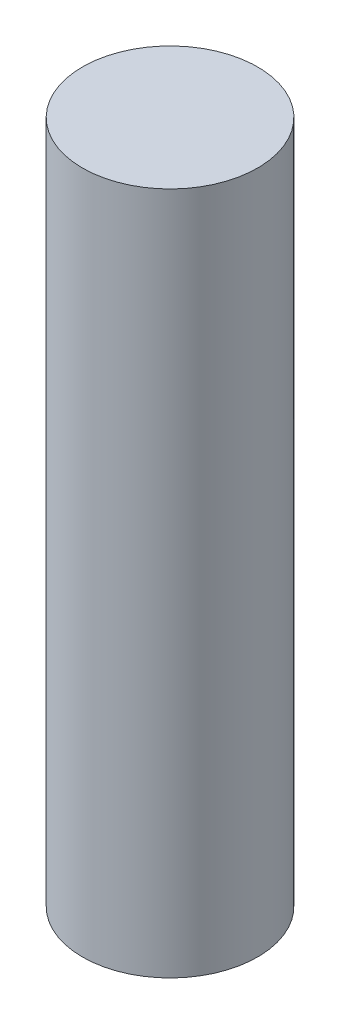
from build123d import *

# Parameters (mm, degrees)
SKETCH1_R      = 5
EXTRUDE1_DEPTH = 39


with BuildPart() as part:
    # Sketch1 → Extrude1 (new body)
    with BuildSketch(Plane(origin=(0, 0, 0), x_dir=(1, 0, 0), z_dir=(0, 1, 0))):
        with Locations(Location((0, 0, 0), (0, 0, 270))):
            Circle(SKETCH1_R)
    extrude(amount=EXTRUDE1_DEPTH)


solid = part.part
